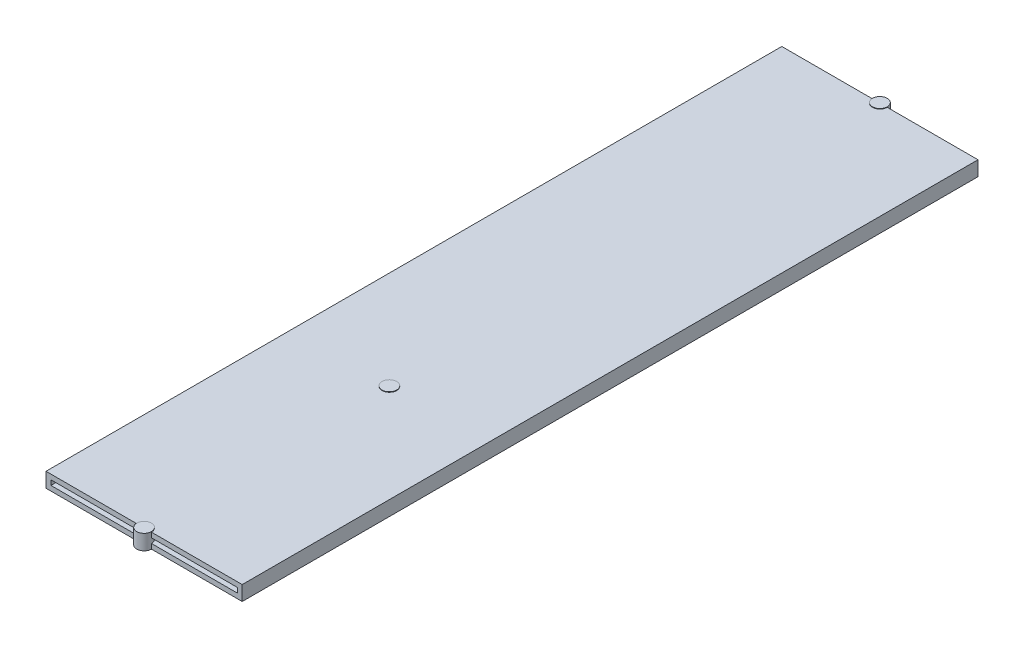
ISO-10303-21;
HEADER;
FILE_DESCRIPTION(('STEP AP214'),'2;1');
FILE_NAME('part.step','',(''),(''),'','','');
FILE_SCHEMA(('AUTOMOTIVE_DESIGN { 1 0 10303 214 1 1 1 1 }'));
ENDSEC;
DATA;
#1=APPLICATION_CONTEXT('core data for automotive mechanical design processes');
#2=APPLICATION_PROTOCOL_DEFINITION('international standard','automotive_design',2000,#1);
#3=PRODUCT_CONTEXT('',#1,'mechanical');
#4=PRODUCT('Part','Part','',(#3));
#5=PRODUCT_RELATED_PRODUCT_CATEGORY('part','',(#4));
#6=PRODUCT_DEFINITION_FORMATION('','',#4);
#7=PRODUCT_DEFINITION_CONTEXT('part definition',#1,'design');
#8=PRODUCT_DEFINITION('design','',#6,#7);
#9=PRODUCT_DEFINITION_SHAPE('','',#8);
#10=(LENGTH_UNIT() NAMED_UNIT(*) SI_UNIT(.MILLI.,.METRE.));
#11=(NAMED_UNIT(*) PLANE_ANGLE_UNIT() SI_UNIT($,.RADIAN.));
#12=(NAMED_UNIT(*) SI_UNIT($,.STERADIAN.) SOLID_ANGLE_UNIT());
#13=UNCERTAINTY_MEASURE_WITH_UNIT(LENGTH_MEASURE(1.E-05),#10,'distance_accuracy_value','');
#14=(GEOMETRIC_REPRESENTATION_CONTEXT(3) GLOBAL_UNCERTAINTY_ASSIGNED_CONTEXT((#13)) GLOBAL_UNIT_ASSIGNED_CONTEXT((#10,
#11,#12)) REPRESENTATION_CONTEXT('',''));
#15=CARTESIAN_POINT('',(0.,0.,0.));
#16=DIRECTION('',(0.,0.,1.));
#17=DIRECTION('',(1.,0.,0.));
#18=AXIS2_PLACEMENT_3D('',#15,#16,#17);
#19=CARTESIAN_POINT('',(0.,0.,-1000.));
#20=DIRECTION('',(0.,0.,1.));
#21=DIRECTION('',(1.,0.,0.));
#22=AXIS2_PLACEMENT_3D('',#19,#20,#21);
#23=PLANE('',#22);
#24=DIRECTION('',(1.,0.,0.));
#25=VECTOR('',#24,1.);
#26=CARTESIAN_POINT('',(-200.,-15.,-1000.));
#27=LINE('',#26,#25);
#28=CARTESIAN_POINT('',(14.9999999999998,-15.,-1000.));
#29=VERTEX_POINT('',#28);
#30=CARTESIAN_POINT('',(200.,-15.,-1000.));
#31=VERTEX_POINT('',#30);
#32=EDGE_CURVE('E160',#29,#31,#27,.T.);
#33=ORIENTED_EDGE('',*,*,#32,.F.);
#34=DIRECTION('',(0.,1.,0.));
#35=VECTOR('',#34,1.);
#36=CARTESIAN_POINT('',(14.9999999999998,-15.,-1000.));
#37=LINE('',#36,#35);
#38=CARTESIAN_POINT('',(14.9999999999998,-5.00000000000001,-1000.));
#39=VERTEX_POINT('',#38);
#40=EDGE_CURVE('E147',#29,#39,#37,.T.);
#41=ORIENTED_EDGE('',*,*,#40,.T.);
#42=DIRECTION('',(1.,0.,0.));
#43=VECTOR('',#42,1.);
#44=CARTESIAN_POINT('',(-190.,-5.00000000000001,-1000.));
#45=LINE('',#44,#43);
#46=CARTESIAN_POINT('',(190.,-5.00000000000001,-1000.));
#47=VERTEX_POINT('',#46);
#48=EDGE_CURVE('E255',#39,#47,#45,.T.);
#49=ORIENTED_EDGE('',*,*,#48,.T.);
#50=DIRECTION('',(0.,1.,0.));
#51=VECTOR('',#50,1.);
#52=CARTESIAN_POINT('',(190.,4.99999999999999,-1000.));
#53=LINE('',#52,#51);
#54=CARTESIAN_POINT('',(190.,4.99999999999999,-1000.));
#55=VERTEX_POINT('',#54);
#56=EDGE_CURVE('E259',#47,#55,#53,.T.);
#57=ORIENTED_EDGE('',*,*,#56,.T.);
#58=DIRECTION('',(-1.,0.,0.));
#59=VECTOR('',#58,1.);
#60=CARTESIAN_POINT('',(-190.,4.99999999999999,-1000.));
#61=LINE('',#60,#59);
#62=CARTESIAN_POINT('',(14.9999999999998,4.99999999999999,-1000.));
#63=VERTEX_POINT('',#62);
#64=EDGE_CURVE('E263',#55,#63,#61,.T.);
#65=ORIENTED_EDGE('',*,*,#64,.T.);
#66=CARTESIAN_POINT('',(14.9999999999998,15.,-1000.));
#67=VERTEX_POINT('',#66);
#68=EDGE_CURVE('E52',#63,#67,#37,.T.);
#69=ORIENTED_EDGE('',*,*,#68,.T.);
#70=DIRECTION('',(-1.,0.,0.));
#71=VECTOR('',#70,1.);
#72=CARTESIAN_POINT('',(-200.,15.,-1000.));
#73=LINE('',#72,#71);
#74=CARTESIAN_POINT('',(200.,15.,-1000.));
#75=VERTEX_POINT('',#74);
#76=EDGE_CURVE('E174',#75,#67,#73,.T.);
#77=ORIENTED_EDGE('',*,*,#76,.F.);
#78=DIRECTION('',(0.,1.,0.));
#79=VECTOR('',#78,1.);
#80=CARTESIAN_POINT('',(200.,15.,-1000.));
#81=LINE('',#80,#79);
#82=EDGE_CURVE('E169',#31,#75,#81,.T.);
#83=ORIENTED_EDGE('',*,*,#82,.F.);
#84=EDGE_LOOP('',(#33,#41,#49,#57,#65,#69,#77,#83));
#85=FACE_BOUND('',#84,.T.);
#86=ADVANCED_FACE('F37',(#85),#23,.F.);
#87=CARTESIAN_POINT('',(0.,0.,500.));
#88=DIRECTION('',(0.,0.,1.));
#89=DIRECTION('',(1.,0.,0.));
#90=AXIS2_PLACEMENT_3D('',#87,#88,#89);
#91=PLANE('',#90);
#92=DIRECTION('',(0.,1.,0.));
#93=VECTOR('',#92,1.);
#94=CARTESIAN_POINT('',(14.9999999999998,-15.,500.));
#95=LINE('',#94,#93);
#96=CARTESIAN_POINT('',(14.9999999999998,-15.,500.));
#97=VERTEX_POINT('',#96);
#98=CARTESIAN_POINT('',(14.9999999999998,-5.00000000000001,500.));
#99=VERTEX_POINT('',#98);
#100=EDGE_CURVE('E192',#97,#99,#95,.T.);
#101=ORIENTED_EDGE('',*,*,#100,.F.);
#102=DIRECTION('',(1.,0.,0.));
#103=VECTOR('',#102,1.);
#104=CARTESIAN_POINT('',(-200.,-15.,500.));
#105=LINE('',#104,#103);
#106=CARTESIAN_POINT('',(200.,-15.,500.));
#107=VERTEX_POINT('',#106);
#108=EDGE_CURVE('E249',#97,#107,#105,.T.);
#109=ORIENTED_EDGE('',*,*,#108,.T.);
#110=DIRECTION('',(0.,1.,0.));
#111=VECTOR('',#110,1.);
#112=CARTESIAN_POINT('',(200.,15.,500.));
#113=LINE('',#112,#111);
#114=CARTESIAN_POINT('',(200.,15.,500.));
#115=VERTEX_POINT('',#114);
#116=EDGE_CURVE('E239',#107,#115,#113,.T.);
#117=ORIENTED_EDGE('',*,*,#116,.T.);
#118=DIRECTION('',(-1.,0.,0.));
#119=VECTOR('',#118,1.);
#120=CARTESIAN_POINT('',(-200.,15.,500.));
#121=LINE('',#120,#119);
#122=CARTESIAN_POINT('',(14.9999999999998,15.,500.));
#123=VERTEX_POINT('',#122);
#124=EDGE_CURVE('E243',#115,#123,#121,.T.);
#125=ORIENTED_EDGE('',*,*,#124,.T.);
#126=CARTESIAN_POINT('',(14.9999999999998,4.99999999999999,500.));
#127=VERTEX_POINT('',#126);
#128=EDGE_CURVE('E190',#127,#123,#95,.T.);
#129=ORIENTED_EDGE('',*,*,#128,.F.);
#130=DIRECTION('',(-1.,0.,0.));
#131=VECTOR('',#130,1.);
#132=CARTESIAN_POINT('',(-190.,4.99999999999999,500.));
#133=LINE('',#132,#131);
#134=CARTESIAN_POINT('',(190.,4.99999999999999,500.));
#135=VERTEX_POINT('',#134);
#136=EDGE_CURVE('E236',#135,#127,#133,.T.);
#137=ORIENTED_EDGE('',*,*,#136,.F.);
#138=DIRECTION('',(0.,1.,0.));
#139=VECTOR('',#138,1.);
#140=CARTESIAN_POINT('',(190.,4.99999999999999,500.));
#141=LINE('',#140,#139);
#142=CARTESIAN_POINT('',(190.,-5.00000000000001,500.));
#143=VERTEX_POINT('',#142);
#144=EDGE_CURVE('E232',#143,#135,#141,.T.);
#145=ORIENTED_EDGE('',*,*,#144,.F.);
#146=DIRECTION('',(1.,0.,0.));
#147=VECTOR('',#146,1.);
#148=CARTESIAN_POINT('',(-190.,-5.00000000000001,500.));
#149=LINE('',#148,#147);
#150=EDGE_CURVE('E228',#99,#143,#149,.T.);
#151=ORIENTED_EDGE('',*,*,#150,.F.);
#152=EDGE_LOOP('',(#101,#109,#117,#125,#129,#137,#145,#151));
#153=FACE_BOUND('',#152,.T.);
#154=ADVANCED_FACE('F314',(#153),#91,.T.);
#155=CARTESIAN_POINT('',(200.,15.,-1000.));
#156=DIRECTION('',(1.,0.,0.));
#157=DIRECTION('',(0.,0.,-1.));
#158=AXIS2_PLACEMENT_3D('',#155,#156,#157);
#159=PLANE('',#158);
#160=DIRECTION('',(0.,0.,1.));
#161=VECTOR('',#160,1.);
#162=CARTESIAN_POINT('',(200.,15.,-1000.));
#163=LINE('',#162,#161);
#164=EDGE_CURVE('E172',#75,#115,#163,.T.);
#165=ORIENTED_EDGE('',*,*,#164,.T.);
#166=ORIENTED_EDGE('',*,*,#116,.F.);
#167=DIRECTION('',(0.,0.,1.));
#168=VECTOR('',#167,1.);
#169=CARTESIAN_POINT('',(200.,-15.,-1000.));
#170=LINE('',#169,#168);
#171=EDGE_CURVE('E178',#31,#107,#170,.T.);
#172=ORIENTED_EDGE('',*,*,#171,.F.);
#173=ORIENTED_EDGE('',*,*,#82,.T.);
#174=EDGE_LOOP('',(#165,#166,#172,#173));
#175=FACE_BOUND('',#174,.T.);
#176=ADVANCED_FACE('F39',(#175),#159,.T.);
#177=CARTESIAN_POINT('',(-200.,-15.,-1000.));
#178=DIRECTION('',(0.,-1.,0.));
#179=DIRECTION('',(0.,0.,-1.));
#180=AXIS2_PLACEMENT_3D('',#177,#178,#179);
#181=PLANE('',#180);
#182=CARTESIAN_POINT('',(-200.,-15.,-1000.));
#183=VERTEX_POINT('',#182);
#184=CARTESIAN_POINT('',(-15.0000000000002,-15.,-1000.));
#185=VERTEX_POINT('',#184);
#186=EDGE_CURVE('E163',#183,#185,#27,.T.);
#187=ORIENTED_EDGE('',*,*,#186,.T.);
#188=CARTESIAN_POINT('',(-1.66533453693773E-13,-15.,-1000.));
#189=DIRECTION('',(0.,1.,0.));
#190=DIRECTION('',(0.,0.,1.));
#191=AXIS2_PLACEMENT_3D('',#188,#189,#190);
#192=CIRCLE('',#191,15.);
#193=EDGE_CURVE('E150',#29,#185,#192,.T.);
#194=ORIENTED_EDGE('',*,*,#193,.F.);
#195=ORIENTED_EDGE('',*,*,#32,.T.);
#196=ORIENTED_EDGE('',*,*,#171,.T.);
#197=ORIENTED_EDGE('',*,*,#108,.F.);
#198=CARTESIAN_POINT('',(-1.66533453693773E-13,-15.,500.));
#199=DIRECTION('',(0.,1.,0.));
#200=DIRECTION('',(0.,0.,1.));
#201=AXIS2_PLACEMENT_3D('',#198,#199,#200);
#202=CIRCLE('',#201,15.);
#203=CARTESIAN_POINT('',(-15.0000000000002,-15.,500.));
#204=VERTEX_POINT('',#203);
#205=EDGE_CURVE('E214',#204,#97,#202,.T.);
#206=ORIENTED_EDGE('',*,*,#205,.F.);
#207=CARTESIAN_POINT('',(-200.,-15.,500.));
#208=VERTEX_POINT('',#207);
#209=EDGE_CURVE('E250',#208,#204,#105,.T.);
#210=ORIENTED_EDGE('',*,*,#209,.F.);
#211=DIRECTION('',(0.,0.,1.));
#212=VECTOR('',#211,1.);
#213=CARTESIAN_POINT('',(-200.,-15.,-1000.));
#214=LINE('',#213,#212);
#215=EDGE_CURVE('E181',#183,#208,#214,.T.);
#216=ORIENTED_EDGE('',*,*,#215,.F.);
#217=EDGE_LOOP('',(#187,#194,#195,#196,#197,#206,#210,#216));
#218=FACE_BOUND('',#217,.T.);
#219=ADVANCED_FACE('F158',(#218),#181,.T.);
#220=CARTESIAN_POINT('',(-200.,15.,-1000.));
#221=DIRECTION('',(-1.,0.,0.));
#222=DIRECTION('',(0.,0.,1.));
#223=AXIS2_PLACEMENT_3D('',#220,#221,#222);
#224=PLANE('',#223);
#225=ORIENTED_EDGE('',*,*,#215,.T.);
#226=DIRECTION('',(0.,-1.,0.));
#227=VECTOR('',#226,1.);
#228=CARTESIAN_POINT('',(-200.,15.,500.));
#229=LINE('',#228,#227);
#230=CARTESIAN_POINT('',(-200.,15.,500.));
#231=VERTEX_POINT('',#230);
#232=EDGE_CURVE('E246',#231,#208,#229,.T.);
#233=ORIENTED_EDGE('',*,*,#232,.F.);
#234=DIRECTION('',(0.,0.,1.));
#235=VECTOR('',#234,1.);
#236=CARTESIAN_POINT('',(-200.,15.,-1000.));
#237=LINE('',#236,#235);
#238=CARTESIAN_POINT('',(-200.,15.,-1000.));
#239=VERTEX_POINT('',#238);
#240=EDGE_CURVE('E183',#239,#231,#237,.T.);
#241=ORIENTED_EDGE('',*,*,#240,.F.);
#242=DIRECTION('',(0.,-1.,0.));
#243=VECTOR('',#242,1.);
#244=CARTESIAN_POINT('',(-200.,15.,-1000.));
#245=LINE('',#244,#243);
#246=EDGE_CURVE('E170',#239,#183,#245,.T.);
#247=ORIENTED_EDGE('',*,*,#246,.T.);
#248=EDGE_LOOP('',(#225,#233,#241,#247));
#249=FACE_BOUND('',#248,.T.);
#250=ADVANCED_FACE('F290',(#249),#224,.T.);
#251=CARTESIAN_POINT('',(-200.,15.,-1000.));
#252=DIRECTION('',(0.,1.,0.));
#253=DIRECTION('',(0.,0.,1.));
#254=AXIS2_PLACEMENT_3D('',#251,#252,#253);
#255=PLANE('',#254);
#256=CARTESIAN_POINT('',(-1.66533453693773E-13,15.,-1000.));
#257=DIRECTION('',(0.,1.,0.));
#258=DIRECTION('',(0.,0.,1.));
#259=AXIS2_PLACEMENT_3D('',#256,#257,#258);
#260=CIRCLE('',#259,15.);
#261=CARTESIAN_POINT('',(-15.0000000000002,15.,-1000.));
#262=VERTEX_POINT('',#261);
#263=EDGE_CURVE('E203',#262,#67,#260,.T.);
#264=ORIENTED_EDGE('',*,*,#263,.F.);
#265=EDGE_CURVE('E276',#262,#239,#73,.T.);
#266=ORIENTED_EDGE('',*,*,#265,.T.);
#267=ORIENTED_EDGE('',*,*,#240,.T.);
#268=CARTESIAN_POINT('',(-15.0000000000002,15.,500.));
#269=VERTEX_POINT('',#268);
#270=EDGE_CURVE('E242',#269,#231,#121,.T.);
#271=ORIENTED_EDGE('',*,*,#270,.F.);
#272=CARTESIAN_POINT('',(-1.66533453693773E-13,15.,500.));
#273=DIRECTION('',(0.,1.,0.));
#274=DIRECTION('',(0.,0.,1.));
#275=AXIS2_PLACEMENT_3D('',#272,#273,#274);
#276=CIRCLE('',#275,15.);
#277=EDGE_CURVE('E222',#123,#269,#276,.T.);
#278=ORIENTED_EDGE('',*,*,#277,.F.);
#279=ORIENTED_EDGE('',*,*,#124,.F.);
#280=ORIENTED_EDGE('',*,*,#164,.F.);
#281=ORIENTED_EDGE('',*,*,#76,.T.);
#282=EDGE_LOOP('',(#264,#266,#267,#271,#278,#279,#280,#281));
#283=FACE_BOUND('',#282,.T.);
#284=CARTESIAN_POINT('',(0.,15.,0.));
#285=DIRECTION('',(0.,1.,0.));
#286=DIRECTION('',(0.,0.,1.));
#287=AXIS2_PLACEMENT_3D('',#284,#285,#286);
#288=CIRCLE('',#287,15.);
#289=CARTESIAN_POINT('',(0.,15.,15.));
#290=VERTEX_POINT('',#289);
#291=EDGE_CURVE('E45',#290,#290,#288,.T.);
#292=ORIENTED_EDGE('',*,*,#291,.F.);
#293=EDGE_LOOP('',(#292));
#294=FACE_BOUND('',#293,.T.);
#295=ADVANCED_FACE('F282',(#283,#294),#255,.T.);
#296=ORIENTED_EDGE('',*,*,#265,.F.);
#297=DIRECTION('',(0.,1.,0.));
#298=VECTOR('',#297,1.);
#299=CARTESIAN_POINT('',(-15.0000000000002,-15.,-1000.));
#300=LINE('',#299,#298);
#301=CARTESIAN_POINT('',(-15.0000000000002,4.99999999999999,-1000.));
#302=VERTEX_POINT('',#301);
#303=EDGE_CURVE('E294',#262,#302,#300,.F.);
#304=ORIENTED_EDGE('',*,*,#303,.T.);
#305=CARTESIAN_POINT('',(-190.,4.99999999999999,-1000.));
#306=VERTEX_POINT('',#305);
#307=EDGE_CURVE('E262',#302,#306,#61,.T.);
#308=ORIENTED_EDGE('',*,*,#307,.T.);
#309=DIRECTION('',(0.,-1.,0.));
#310=VECTOR('',#309,1.);
#311=CARTESIAN_POINT('',(-190.,4.99999999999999,-1000.));
#312=LINE('',#311,#310);
#313=CARTESIAN_POINT('',(-190.,-5.00000000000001,-1000.));
#314=VERTEX_POINT('',#313);
#315=EDGE_CURVE('E252',#306,#314,#312,.T.);
#316=ORIENTED_EDGE('',*,*,#315,.T.);
#317=CARTESIAN_POINT('',(-15.0000000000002,-5.00000000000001,-1000.));
#318=VERTEX_POINT('',#317);
#319=EDGE_CURVE('E256',#314,#318,#45,.T.);
#320=ORIENTED_EDGE('',*,*,#319,.T.);
#321=EDGE_CURVE('E60',#318,#185,#300,.F.);
#322=ORIENTED_EDGE('',*,*,#321,.T.);
#323=ORIENTED_EDGE('',*,*,#186,.F.);
#324=ORIENTED_EDGE('',*,*,#246,.F.);
#325=EDGE_LOOP('',(#296,#304,#308,#316,#320,#322,#323,#324));
#326=FACE_BOUND('',#325,.T.);
#327=ADVANCED_FACE('F291',(#326),#23,.F.);
#328=CARTESIAN_POINT('',(-190.,4.99999999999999,-1000.));
#329=DIRECTION('',(-1.,0.,0.));
#330=DIRECTION('',(0.,0.,1.));
#331=AXIS2_PLACEMENT_3D('',#328,#329,#330);
#332=PLANE('',#331);
#333=DIRECTION('',(0.,0.,1.));
#334=VECTOR('',#333,1.);
#335=CARTESIAN_POINT('',(-190.,4.99999999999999,-1000.));
#336=LINE('',#335,#334);
#337=CARTESIAN_POINT('',(-190.,4.99999999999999,500.));
#338=VERTEX_POINT('',#337);
#339=EDGE_CURVE('E267',#306,#338,#336,.T.);
#340=ORIENTED_EDGE('',*,*,#339,.T.);
#341=DIRECTION('',(0.,-1.,0.));
#342=VECTOR('',#341,1.);
#343=CARTESIAN_POINT('',(-190.,4.99999999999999,500.));
#344=LINE('',#343,#342);
#345=CARTESIAN_POINT('',(-190.,-5.00000000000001,500.));
#346=VERTEX_POINT('',#345);
#347=EDGE_CURVE('E225',#338,#346,#344,.T.);
#348=ORIENTED_EDGE('',*,*,#347,.T.);
#349=DIRECTION('',(0.,0.,1.));
#350=VECTOR('',#349,1.);
#351=CARTESIAN_POINT('',(-190.,-5.00000000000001,-1000.));
#352=LINE('',#351,#350);
#353=EDGE_CURVE('E266',#314,#346,#352,.T.);
#354=ORIENTED_EDGE('',*,*,#353,.F.);
#355=ORIENTED_EDGE('',*,*,#315,.F.);
#356=EDGE_LOOP('',(#340,#348,#354,#355));
#357=FACE_BOUND('',#356,.T.);
#358=ADVANCED_FACE('F331',(#357),#332,.F.);
#359=CARTESIAN_POINT('',(-190.,4.99999999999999,-1000.));
#360=DIRECTION('',(0.,1.,0.));
#361=DIRECTION('',(0.,0.,1.));
#362=AXIS2_PLACEMENT_3D('',#359,#360,#361);
#363=PLANE('',#362);
#364=CARTESIAN_POINT('',(0.,4.99999999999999,0.));
#365=DIRECTION('',(0.,1.,0.));
#366=DIRECTION('',(0.,0.,1.));
#367=AXIS2_PLACEMENT_3D('',#364,#365,#366);
#368=CIRCLE('',#367,15.);
#369=CARTESIAN_POINT('',(0.,4.99999999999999,15.));
#370=VERTEX_POINT('',#369);
#371=EDGE_CURVE('E195',#370,#370,#368,.T.);
#372=ORIENTED_EDGE('',*,*,#371,.T.);
#373=EDGE_LOOP('',(#372));
#374=FACE_BOUND('',#373,.T.);
#375=ORIENTED_EDGE('',*,*,#307,.F.);
#376=CARTESIAN_POINT('',(-1.66533453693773E-13,4.99999999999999,-1000.));
#377=DIRECTION('',(0.,1.,0.));
#378=DIRECTION('',(0.,0.,1.));
#379=AXIS2_PLACEMENT_3D('',#376,#377,#378);
#380=CIRCLE('',#379,15.);
#381=EDGE_CURVE('E154',#302,#63,#380,.T.);
#382=ORIENTED_EDGE('',*,*,#381,.T.);
#383=ORIENTED_EDGE('',*,*,#64,.F.);
#384=DIRECTION('',(0.,0.,1.));
#385=VECTOR('',#384,1.);
#386=CARTESIAN_POINT('',(190.,4.99999999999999,-1000.));
#387=LINE('',#386,#385);
#388=EDGE_CURVE('E270',#55,#135,#387,.T.);
#389=ORIENTED_EDGE('',*,*,#388,.T.);
#390=ORIENTED_EDGE('',*,*,#136,.T.);
#391=CARTESIAN_POINT('',(-1.66533453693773E-13,4.99999999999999,500.));
#392=DIRECTION('',(0.,1.,0.));
#393=DIRECTION('',(0.,0.,1.));
#394=AXIS2_PLACEMENT_3D('',#391,#392,#393);
#395=CIRCLE('',#394,15.);
#396=CARTESIAN_POINT('',(-15.0000000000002,4.99999999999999,500.));
#397=VERTEX_POINT('',#396);
#398=EDGE_CURVE('E219',#127,#397,#395,.T.);
#399=ORIENTED_EDGE('',*,*,#398,.T.);
#400=EDGE_CURVE('E235',#397,#338,#133,.T.);
#401=ORIENTED_EDGE('',*,*,#400,.T.);
#402=ORIENTED_EDGE('',*,*,#339,.F.);
#403=EDGE_LOOP('',(#375,#382,#383,#389,#390,#399,#401,#402));
#404=FACE_BOUND('',#403,.T.);
#405=ADVANCED_FACE('F300',(#374,#404),#363,.F.);
#406=CARTESIAN_POINT('',(190.,4.99999999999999,-1000.));
#407=DIRECTION('',(1.,0.,0.));
#408=DIRECTION('',(0.,0.,-1.));
#409=AXIS2_PLACEMENT_3D('',#406,#407,#408);
#410=PLANE('',#409);
#411=DIRECTION('',(0.,0.,1.));
#412=VECTOR('',#411,1.);
#413=CARTESIAN_POINT('',(190.,-5.00000000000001,-1000.));
#414=LINE('',#413,#412);
#415=EDGE_CURVE('E272',#47,#143,#414,.T.);
#416=ORIENTED_EDGE('',*,*,#415,.T.);
#417=ORIENTED_EDGE('',*,*,#144,.T.);
#418=ORIENTED_EDGE('',*,*,#388,.F.);
#419=ORIENTED_EDGE('',*,*,#56,.F.);
#420=EDGE_LOOP('',(#416,#417,#418,#419));
#421=FACE_BOUND('',#420,.T.);
#422=ADVANCED_FACE('F305',(#421),#410,.F.);
#423=CARTESIAN_POINT('',(-190.,-5.00000000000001,-1000.));
#424=DIRECTION('',(0.,-1.,0.));
#425=DIRECTION('',(0.,0.,-1.));
#426=AXIS2_PLACEMENT_3D('',#423,#424,#425);
#427=PLANE('',#426);
#428=CARTESIAN_POINT('',(0.,-5.00000000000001,0.));
#429=DIRECTION('',(0.,-1.,0.));
#430=DIRECTION('',(0.,0.,-1.));
#431=AXIS2_PLACEMENT_3D('',#428,#429,#430);
#432=CIRCLE('',#431,15.);
#433=CARTESIAN_POINT('',(0.,-5.00000000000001,-15.));
#434=VERTEX_POINT('',#433);
#435=EDGE_CURVE('E193',#434,#434,#432,.T.);
#436=ORIENTED_EDGE('',*,*,#435,.T.);
#437=EDGE_LOOP('',(#436));
#438=FACE_BOUND('',#437,.T.);
#439=ORIENTED_EDGE('',*,*,#48,.F.);
#440=CARTESIAN_POINT('',(-1.66533453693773E-13,-5.00000000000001,-1000.));
#441=DIRECTION('',(0.,-1.,0.));
#442=DIRECTION('',(0.,0.,-1.));
#443=AXIS2_PLACEMENT_3D('',#440,#441,#442);
#444=CIRCLE('',#443,15.);
#445=EDGE_CURVE('E11',#39,#318,#444,.T.);
#446=ORIENTED_EDGE('',*,*,#445,.T.);
#447=ORIENTED_EDGE('',*,*,#319,.F.);
#448=ORIENTED_EDGE('',*,*,#353,.T.);
#449=CARTESIAN_POINT('',(-15.0000000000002,-5.00000000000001,500.));
#450=VERTEX_POINT('',#449);
#451=EDGE_CURVE('E229',#346,#450,#149,.T.);
#452=ORIENTED_EDGE('',*,*,#451,.T.);
#453=CARTESIAN_POINT('',(-1.66533453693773E-13,-5.00000000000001,500.));
#454=DIRECTION('',(0.,-1.,0.));
#455=DIRECTION('',(0.,0.,-1.));
#456=AXIS2_PLACEMENT_3D('',#453,#454,#455);
#457=CIRCLE('',#456,15.);
#458=EDGE_CURVE('E217',#450,#99,#457,.T.);
#459=ORIENTED_EDGE('',*,*,#458,.T.);
#460=ORIENTED_EDGE('',*,*,#150,.T.);
#461=ORIENTED_EDGE('',*,*,#415,.F.);
#462=EDGE_LOOP('',(#439,#446,#447,#448,#452,#459,#460,#461));
#463=FACE_BOUND('',#462,.T.);
#464=ADVANCED_FACE('F308',(#438,#463),#427,.F.);
#465=DIRECTION('',(0.,1.,0.));
#466=VECTOR('',#465,1.);
#467=CARTESIAN_POINT('',(-15.0000000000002,-15.,500.));
#468=LINE('',#467,#466);
#469=EDGE_CURVE('E189',#269,#397,#468,.F.);
#470=ORIENTED_EDGE('',*,*,#469,.F.);
#471=ORIENTED_EDGE('',*,*,#270,.T.);
#472=ORIENTED_EDGE('',*,*,#232,.T.);
#473=ORIENTED_EDGE('',*,*,#209,.T.);
#474=EDGE_CURVE('E180',#450,#204,#468,.F.);
#475=ORIENTED_EDGE('',*,*,#474,.F.);
#476=ORIENTED_EDGE('',*,*,#451,.F.);
#477=ORIENTED_EDGE('',*,*,#347,.F.);
#478=ORIENTED_EDGE('',*,*,#400,.F.);
#479=EDGE_LOOP('',(#470,#471,#472,#473,#475,#476,#477,#478));
#480=FACE_BOUND('',#479,.T.);
#481=ADVANCED_FACE('F333',(#480),#91,.T.);
#482=CARTESIAN_POINT('',(-1.66533453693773E-13,-15.,500.));
#483=DIRECTION('',(0.,1.,0.));
#484=DIRECTION('',(0.,0.,1.));
#485=AXIS2_PLACEMENT_3D('',#482,#483,#484);
#486=CYLINDRICAL_SURFACE('',#485,15.);
#487=ORIENTED_EDGE('',*,*,#398,.F.);
#488=ORIENTED_EDGE('',*,*,#128,.T.);
#489=ORIENTED_EDGE('',*,*,#277,.T.);
#490=ORIENTED_EDGE('',*,*,#469,.T.);
#491=EDGE_LOOP('',(#487,#488,#489,#490));
#492=FACE_BOUND('',#491,.T.);
#493=ORIENTED_EDGE('',*,*,#205,.T.);
#494=ORIENTED_EDGE('',*,*,#100,.T.);
#495=ORIENTED_EDGE('',*,*,#458,.F.);
#496=ORIENTED_EDGE('',*,*,#474,.T.);
#497=EDGE_LOOP('',(#493,#494,#495,#496));
#498=FACE_BOUND('',#497,.T.);
#499=CARTESIAN_POINT('',(-1.66533453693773E-13,16.,500.));
#500=DIRECTION('',(0.,1.,0.));
#501=DIRECTION('',(0.,0.,1.));
#502=AXIS2_PLACEMENT_3D('',#499,#500,#501);
#503=CIRCLE('',#502,15.);
#504=CARTESIAN_POINT('',(-1.66533453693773E-13,16.,515.));
#505=VERTEX_POINT('',#504);
#506=EDGE_CURVE('E200',#505,#505,#503,.T.);
#507=ORIENTED_EDGE('',*,*,#506,.F.);
#508=EDGE_LOOP('',(#507));
#509=FACE_BOUND('',#508,.T.);
#510=ADVANCED_FACE('F317',(#492,#498,#509),#486,.T.);
#511=CARTESIAN_POINT('',(-1.66533453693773E-13,16.,500.));
#512=DIRECTION('',(0.,1.,0.));
#513=DIRECTION('',(0.,0.,1.));
#514=AXIS2_PLACEMENT_3D('',#511,#512,#513);
#515=PLANE('',#514);
#516=ORIENTED_EDGE('',*,*,#506,.T.);
#517=EDGE_LOOP('',(#516));
#518=FACE_BOUND('',#517,.T.);
#519=ADVANCED_FACE('F340',(#518),#515,.T.);
#520=CARTESIAN_POINT('',(0.,-15.,0.));
#521=DIRECTION('',(0.,1.,0.));
#522=DIRECTION('',(0.,0.,1.));
#523=AXIS2_PLACEMENT_3D('',#520,#521,#522);
#524=CYLINDRICAL_SURFACE('',#523,15.);
#525=ORIENTED_EDGE('',*,*,#435,.F.);
#526=EDGE_LOOP('',(#525));
#527=FACE_BOUND('',#526,.T.);
#528=ORIENTED_EDGE('',*,*,#371,.F.);
#529=EDGE_LOOP('',(#528));
#530=FACE_BOUND('',#529,.T.);
#531=ADVANCED_FACE('F424',(#527,#530),#524,.T.);
#532=ORIENTED_EDGE('',*,*,#291,.T.);
#533=EDGE_LOOP('',(#532));
#534=FACE_BOUND('',#533,.T.);
#535=CARTESIAN_POINT('',(0.,16.,0.));
#536=DIRECTION('',(0.,1.,0.));
#537=DIRECTION('',(0.,0.,1.));
#538=AXIS2_PLACEMENT_3D('',#535,#536,#537);
#539=CIRCLE('',#538,15.);
#540=CARTESIAN_POINT('',(0.,16.,15.));
#541=VERTEX_POINT('',#540);
#542=EDGE_CURVE('E196',#541,#541,#539,.T.);
#543=ORIENTED_EDGE('',*,*,#542,.F.);
#544=EDGE_LOOP('',(#543));
#545=FACE_BOUND('',#544,.T.);
#546=ADVANCED_FACE('F434',(#534,#545),#524,.T.);
#547=CARTESIAN_POINT('',(0.,16.,0.));
#548=DIRECTION('',(0.,1.,0.));
#549=DIRECTION('',(0.,0.,1.));
#550=AXIS2_PLACEMENT_3D('',#547,#548,#549);
#551=PLANE('',#550);
#552=ORIENTED_EDGE('',*,*,#542,.T.);
#553=EDGE_LOOP('',(#552));
#554=FACE_BOUND('',#553,.T.);
#555=ADVANCED_FACE('F444',(#554),#551,.T.);
#556=CARTESIAN_POINT('',(-1.66533453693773E-13,-15.,-1000.));
#557=DIRECTION('',(0.,1.,0.));
#558=DIRECTION('',(0.,0.,1.));
#559=AXIS2_PLACEMENT_3D('',#556,#557,#558);
#560=CYLINDRICAL_SURFACE('',#559,15.);
#561=ORIENTED_EDGE('',*,*,#303,.F.);
#562=ORIENTED_EDGE('',*,*,#263,.T.);
#563=ORIENTED_EDGE('',*,*,#68,.F.);
#564=ORIENTED_EDGE('',*,*,#381,.F.);
#565=EDGE_LOOP('',(#561,#562,#563,#564));
#566=FACE_BOUND('',#565,.T.);
#567=CARTESIAN_POINT('',(-1.66533453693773E-13,16.,-1000.));
#568=DIRECTION('',(0.,1.,0.));
#569=DIRECTION('',(0.,0.,1.));
#570=AXIS2_PLACEMENT_3D('',#567,#568,#569);
#571=CIRCLE('',#570,15.);
#572=CARTESIAN_POINT('',(-1.66533453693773E-13,16.,-985.));
#573=VERTEX_POINT('',#572);
#574=EDGE_CURVE('E164',#573,#573,#571,.T.);
#575=ORIENTED_EDGE('',*,*,#574,.F.);
#576=EDGE_LOOP('',(#575));
#577=FACE_BOUND('',#576,.T.);
#578=ORIENTED_EDGE('',*,*,#40,.F.);
#579=ORIENTED_EDGE('',*,*,#193,.T.);
#580=ORIENTED_EDGE('',*,*,#321,.F.);
#581=ORIENTED_EDGE('',*,*,#445,.F.);
#582=EDGE_LOOP('',(#578,#579,#580,#581));
#583=FACE_BOUND('',#582,.T.);
#584=ADVANCED_FACE('F149',(#566,#577,#583),#560,.T.);
#585=CARTESIAN_POINT('',(-1.66533453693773E-13,16.,-1000.));
#586=DIRECTION('',(0.,1.,0.));
#587=DIRECTION('',(0.,0.,1.));
#588=AXIS2_PLACEMENT_3D('',#585,#586,#587);
#589=PLANE('',#588);
#590=ORIENTED_EDGE('',*,*,#574,.T.);
#591=EDGE_LOOP('',(#590));
#592=FACE_BOUND('',#591,.T.);
#593=ADVANCED_FACE('F461',(#592),#589,.T.);
#594=CLOSED_SHELL('',(#86,#154,#176,#219,#250,#295,#327,#358,#405,#422,#464,#481,#510,#519,#531,
#546,#555,#584,#593));
#595=MANIFOLD_SOLID_BREP('B2',#594);
#596=ADVANCED_BREP_SHAPE_REPRESENTATION('',(#18,#595),#14);
#597=SHAPE_DEFINITION_REPRESENTATION(#9,#596);
ENDSEC;
END-ISO-10303-21;
